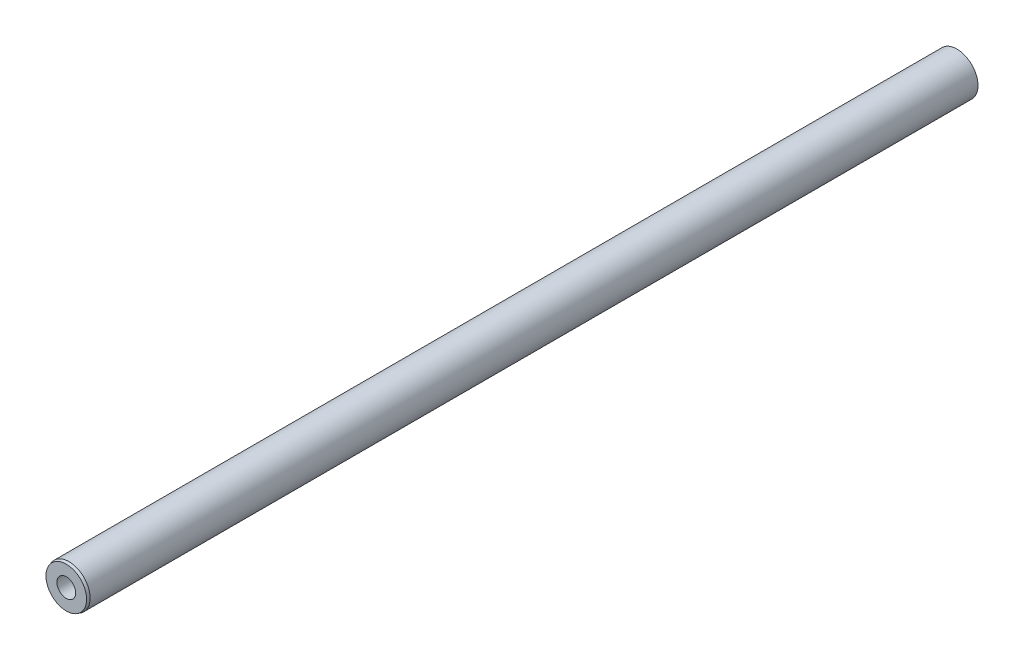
from build123d import *

# Parameters (mm, degrees)
SKETCH1_R          = 9.525
BASE_EXTRUDE_DEPTH = 402.9456
CHAMFER1_SIZE      = 1.27
CHAMFER1_SIZE2     = 0.340295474


with BuildPart() as part:
    # Sketch1 → Base-Extrude (new body)
    with BuildSketch(Plane.XY):
        Circle(SKETCH1_R)
    extrude(amount=BASE_EXTRUDE_DEPTH)

    # Chamfer1
    chamfer1_edges = [part.edges().sort_by_distance(p)[0] for p in [
        (-9.525, 0, 402.9456),
    ]]
    chamfer1_side = [part.faces().sort_by_distance(p)[0] for p in [
        (-9.525, 0, 201.4728),
    ]]
    chamfer(chamfer1_edges, length=CHAMFER1_SIZE, length2=CHAMFER1_SIZE2, reference=chamfer1_side[0])

    # Sketch2 → M10x1.5 Tapped Hole1 (revolve, cut)
    with BuildSketch(Plane(origin=(0, 0, 402.9456), x_dir=(0, -1, 0), z_dir=(1, 0, 0))):
        Polygon((0, 0), (0, 22.553657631), (4.25, 20), (4.25, 0.002539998), (4.25, 0), align=None)
    revolve(axis=Axis((0, 0, 409.2956), (0, 0, -1)), mode=Mode.SUBTRACT)


solid = part.part
